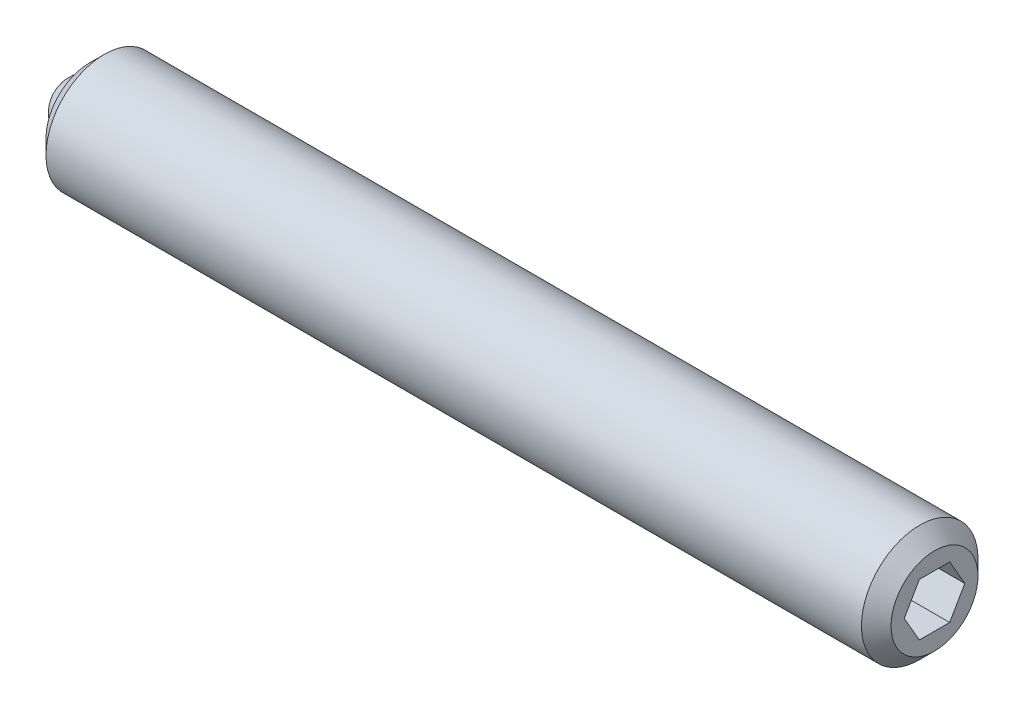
ISO-10303-21;
HEADER;
FILE_DESCRIPTION(('STEP AP214'),'2;1');
FILE_NAME('part.step','',(''),(''),'','','');
FILE_SCHEMA(('AUTOMOTIVE_DESIGN { 1 0 10303 214 1 1 1 1 }'));
ENDSEC;
DATA;
#1=APPLICATION_CONTEXT('core data for automotive mechanical design processes');
#2=APPLICATION_PROTOCOL_DEFINITION('international standard','automotive_design',2000,#1);
#3=PRODUCT_CONTEXT('',#1,'mechanical');
#4=PRODUCT('Part','Part','',(#3));
#5=PRODUCT_RELATED_PRODUCT_CATEGORY('part','',(#4));
#6=PRODUCT_DEFINITION_FORMATION('','',#4);
#7=PRODUCT_DEFINITION_CONTEXT('part definition',#1,'design');
#8=PRODUCT_DEFINITION('design','',#6,#7);
#9=PRODUCT_DEFINITION_SHAPE('','',#8);
#10=(LENGTH_UNIT() NAMED_UNIT(*) SI_UNIT(.MILLI.,.METRE.));
#11=(NAMED_UNIT(*) PLANE_ANGLE_UNIT() SI_UNIT($,.RADIAN.));
#12=(NAMED_UNIT(*) SI_UNIT($,.STERADIAN.) SOLID_ANGLE_UNIT());
#13=UNCERTAINTY_MEASURE_WITH_UNIT(LENGTH_MEASURE(1.E-05),#10,'distance_accuracy_value','');
#14=(GEOMETRIC_REPRESENTATION_CONTEXT(3) GLOBAL_UNCERTAINTY_ASSIGNED_CONTEXT((#13)) GLOBAL_UNIT_ASSIGNED_CONTEXT((#10,
#11,#12)) REPRESENTATION_CONTEXT('',''));
#15=CARTESIAN_POINT('',(0.,0.,0.));
#16=DIRECTION('',(0.,0.,1.));
#17=DIRECTION('',(1.,0.,0.));
#18=AXIS2_PLACEMENT_3D('',#15,#16,#17);
#19=CARTESIAN_POINT('',(0.,0.,0.));
#20=DIRECTION('',(0.,-1.,0.));
#21=DIRECTION('',(0.,0.,-1.));
#22=AXIS2_PLACEMENT_3D('',#19,#20,#21);
#23=SPHERICAL_SURFACE('',#22,0.5);
#24=CARTESIAN_POINT('',(0.,-0.5,0.));
#25=VERTEX_POINT('',#24);
#26=VERTEX_LOOP('',#25);
#27=FACE_BOUND('',#26,.T.);
#28=ADVANCED_FACE('F41',(#27),#23,.T.);
#29=CLOSED_SHELL('',(#28));
#30=MANIFOLD_SOLID_BREP('B2',#29);
#31=CARTESIAN_POINT('',(14.5,0.,0.));
#32=DIRECTION('',(-1.,0.,0.));
#33=DIRECTION('',(0.,0.,1.));
#34=AXIS2_PLACEMENT_3D('',#31,#32,#33);
#35=CYLINDRICAL_SURFACE('',#34,1.);
#36=CARTESIAN_POINT('',(14.246,0.,0.));
#37=DIRECTION('',(1.,0.,0.));
#38=DIRECTION('',(0.,0.,-1.));
#39=AXIS2_PLACEMENT_3D('',#36,#37,#38);
#40=CIRCLE('',#39,1.);
#41=CARTESIAN_POINT('',(14.246,0.,1.));
#42=VERTEX_POINT('',#41);
#43=EDGE_CURVE('E39',#42,#42,#40,.F.);
#44=CARTESIAN_POINT('',(0.254000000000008,0.,0.));
#45=DIRECTION('',(1.,0.,0.));
#46=DIRECTION('',(0.,0.,-1.));
#47=AXIS2_PLACEMENT_3D('',#44,#45,#46);
#48=CIRCLE('',#47,1.);
#49=CARTESIAN_POINT('',(0.254000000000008,0.,1.));
#50=VERTEX_POINT('',#49);
#51=EDGE_CURVE('E157',#50,#50,#48,.T.);
#52=CARTESIAN_POINT('',(14.246,0.,1.));
#53=CARTESIAN_POINT('',(14.10025,0.,1.));
#54=CARTESIAN_POINT('',(13.9545,0.,1.));
#55=CARTESIAN_POINT('',(13.663,0.,1.));
#56=CARTESIAN_POINT('',(13.51725,0.,1.));
#57=CARTESIAN_POINT('',(13.22575,0.,1.));
#58=CARTESIAN_POINT('',(13.08,0.,1.));
#59=CARTESIAN_POINT('',(12.7885,0.,1.));
#60=CARTESIAN_POINT('',(12.64275,0.,1.));
#61=CARTESIAN_POINT('',(12.35125,0.,1.));
#62=CARTESIAN_POINT('',(12.2055,0.,1.));
#63=CARTESIAN_POINT('',(11.914,0.,1.));
#64=CARTESIAN_POINT('',(11.76825,0.,1.));
#65=CARTESIAN_POINT('',(11.47675,0.,1.));
#66=CARTESIAN_POINT('',(11.331,0.,1.));
#67=CARTESIAN_POINT('',(11.0395,0.,1.));
#68=CARTESIAN_POINT('',(10.89375,0.,1.));
#69=CARTESIAN_POINT('',(10.60225,0.,1.));
#70=CARTESIAN_POINT('',(10.4565,0.,1.));
#71=CARTESIAN_POINT('',(10.165,0.,1.));
#72=CARTESIAN_POINT('',(10.01925,0.,1.));
#73=CARTESIAN_POINT('',(9.72775,0.,1.));
#74=CARTESIAN_POINT('',(9.582,0.,1.));
#75=CARTESIAN_POINT('',(9.2905,0.,1.));
#76=CARTESIAN_POINT('',(9.14475,0.,1.));
#77=CARTESIAN_POINT('',(8.85325,0.,1.));
#78=CARTESIAN_POINT('',(8.7075,0.,1.));
#79=CARTESIAN_POINT('',(8.416,0.,1.));
#80=CARTESIAN_POINT('',(8.27025,0.,1.));
#81=CARTESIAN_POINT('',(7.97875,0.,1.));
#82=CARTESIAN_POINT('',(7.833,0.,1.));
#83=CARTESIAN_POINT('',(7.5415,0.,1.));
#84=CARTESIAN_POINT('',(7.39575,0.,1.));
#85=CARTESIAN_POINT('',(7.10425,0.,1.));
#86=CARTESIAN_POINT('',(6.9585,0.,1.));
#87=CARTESIAN_POINT('',(6.667,0.,1.));
#88=CARTESIAN_POINT('',(6.52125,0.,1.));
#89=CARTESIAN_POINT('',(6.22975000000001,0.,1.));
#90=CARTESIAN_POINT('',(6.084,0.,1.));
#91=CARTESIAN_POINT('',(5.79250000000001,0.,1.));
#92=CARTESIAN_POINT('',(5.64675000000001,0.,1.));
#93=CARTESIAN_POINT('',(5.35525000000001,0.,1.));
#94=CARTESIAN_POINT('',(5.20950000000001,0.,1.));
#95=CARTESIAN_POINT('',(4.91800000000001,0.,1.));
#96=CARTESIAN_POINT('',(4.77225000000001,0.,1.));
#97=CARTESIAN_POINT('',(4.48075000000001,0.,1.));
#98=CARTESIAN_POINT('',(4.33500000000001,0.,1.));
#99=CARTESIAN_POINT('',(4.04350000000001,0.,1.));
#100=CARTESIAN_POINT('',(3.89775000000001,0.,1.));
#101=CARTESIAN_POINT('',(3.60625000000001,0.,1.));
#102=CARTESIAN_POINT('',(3.46050000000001,0.,1.));
#103=CARTESIAN_POINT('',(3.16900000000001,0.,1.));
#104=CARTESIAN_POINT('',(3.02325000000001,0.,1.));
#105=CARTESIAN_POINT('',(2.73175000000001,0.,1.));
#106=CARTESIAN_POINT('',(2.58600000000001,0.,1.));
#107=CARTESIAN_POINT('',(2.29450000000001,0.,1.));
#108=CARTESIAN_POINT('',(2.14875000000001,0.,1.));
#109=CARTESIAN_POINT('',(1.85725000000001,0.,1.));
#110=CARTESIAN_POINT('',(1.71150000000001,0.,1.));
#111=CARTESIAN_POINT('',(1.42000000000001,0.,1.));
#112=CARTESIAN_POINT('',(1.27425000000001,0.,1.));
#113=CARTESIAN_POINT('',(0.982750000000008,0.,1.));
#114=CARTESIAN_POINT('',(0.837000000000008,0.,1.));
#115=CARTESIAN_POINT('',(0.545500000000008,0.,1.));
#116=CARTESIAN_POINT('',(0.399750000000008,0.,1.));
#117=CARTESIAN_POINT('',(0.254000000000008,0.,1.));
#118=B_SPLINE_CURVE_WITH_KNOTS('',3,(#52,#53,#54,#55,#56,#57,#58,#59,#60,#61,#62,#63,#64,#65,
#66,#67,#68,#69,#70,#71,#72,#73,#74,#75,#76,#77,#78,#79,#80,#81,#82,#83,#84,#85,#86,#87,#88,#89,
#90,#91,#92,#93,#94,#95,#96,#97,#98,#99,#100,#101,#102,#103,#104,#105,#106,#107,#108,#109,#110,
#111,#112,#113,#114,#115,#116,#117),.UNSPECIFIED.,.F.,.F.,(4,2,2,2,2,2,2,2,2,2,2,2,2,2,2,2,2,2,
2,2,2,2,2,2,2,2,2,2,2,2,2,2,4),(0.,0.437249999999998,0.874499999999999,1.31175,1.749,2.18625,
2.6235,3.06075,3.498,3.93525,4.3725,4.80975,5.247,5.68425,6.1215,6.55875,6.996,7.43325,7.8705,
8.30774999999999,8.74499999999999,9.18224999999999,9.6195,10.05675,10.494,10.93125,11.3685,
11.80575,12.243,12.68025,13.1175,13.55475,13.992),.UNSPECIFIED.);
#119=EDGE_CURVE('BSEAM54',#42,#50,#118,.T.);
#120=ORIENTED_EDGE('',*,*,#43,.T.);
#121=ORIENTED_EDGE('',*,*,#51,.T.);
#122=ORIENTED_EDGE('',*,*,#119,.T.);
#123=ORIENTED_EDGE('',*,*,#119,.F.);
#124=EDGE_LOOP('',(#120,#122,#121,#123));
#125=FACE_BOUND('',#124,.T.);
#126=ADVANCED_FACE('F54',(#125),#35,.T.);
#127=CARTESIAN_POINT('',(14.5,0.,0.));
#128=DIRECTION('',(1.,0.,0.));
#129=DIRECTION('',(0.,0.,-1.));
#130=AXIS2_PLACEMENT_3D('',#127,#128,#129);
#131=PLANE('',#130);
#132=DIRECTION('',(0.,0.866025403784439,-0.5));
#133=VECTOR('',#132,1.);
#134=CARTESIAN_POINT('',(14.5,-0.45,-0.259807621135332));
#135=LINE('',#134,#133);
#136=CARTESIAN_POINT('',(14.5,-0.45,-0.259807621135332));
#137=VERTEX_POINT('',#136);
#138=CARTESIAN_POINT('',(14.5,0.,-0.519615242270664));
#139=VERTEX_POINT('',#138);
#140=EDGE_CURVE('E69',#137,#139,#135,.T.);
#141=ORIENTED_EDGE('',*,*,#140,.F.);
#142=DIRECTION('',(0.,0.,-1.));
#143=VECTOR('',#142,1.);
#144=CARTESIAN_POINT('',(14.5,-0.45,0.259807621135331));
#145=LINE('',#144,#143);
#146=CARTESIAN_POINT('',(14.5,-0.45,0.259807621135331));
#147=VERTEX_POINT('',#146);
#148=EDGE_CURVE('E153',#147,#137,#145,.T.);
#149=ORIENTED_EDGE('',*,*,#148,.F.);
#150=DIRECTION('',(0.,-0.866025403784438,-0.5));
#151=VECTOR('',#150,1.);
#152=CARTESIAN_POINT('',(14.5,0.,0.519615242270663));
#153=LINE('',#152,#151);
#154=CARTESIAN_POINT('',(14.5,0.,0.519615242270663));
#155=VERTEX_POINT('',#154);
#156=EDGE_CURVE('E151',#155,#147,#153,.T.);
#157=ORIENTED_EDGE('',*,*,#156,.F.);
#158=DIRECTION('',(0.,-0.866025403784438,0.5));
#159=VECTOR('',#158,1.);
#160=CARTESIAN_POINT('',(14.5,0.45,0.259807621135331));
#161=LINE('',#160,#159);
#162=CARTESIAN_POINT('',(14.5,0.45,0.259807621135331));
#163=VERTEX_POINT('',#162);
#164=EDGE_CURVE('E117',#163,#155,#161,.T.);
#165=ORIENTED_EDGE('',*,*,#164,.F.);
#166=DIRECTION('',(0.,0.,1.));
#167=VECTOR('',#166,1.);
#168=CARTESIAN_POINT('',(14.5,0.45,-0.259807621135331));
#169=LINE('',#168,#167);
#170=CARTESIAN_POINT('',(14.5,0.45,-0.259807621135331));
#171=VERTEX_POINT('',#170);
#172=EDGE_CURVE('E147',#171,#163,#169,.T.);
#173=ORIENTED_EDGE('',*,*,#172,.F.);
#174=DIRECTION('',(0.,0.866025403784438,0.5));
#175=VECTOR('',#174,1.);
#176=CARTESIAN_POINT('',(14.5,0.,-0.519615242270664));
#177=LINE('',#176,#175);
#178=EDGE_CURVE('E143',#139,#171,#177,.T.);
#179=ORIENTED_EDGE('',*,*,#178,.F.);
#180=EDGE_LOOP('',(#141,#149,#157,#165,#173,#179));
#181=FACE_BOUND('',#180,.T.);
#182=CARTESIAN_POINT('',(14.5,0.,0.));
#183=DIRECTION('',(1.,0.,0.));
#184=DIRECTION('',(0.,0.,-1.));
#185=AXIS2_PLACEMENT_3D('',#182,#183,#184);
#186=CIRCLE('',#185,0.746000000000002);
#187=CARTESIAN_POINT('',(14.5,0.,-0.746000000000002));
#188=VERTEX_POINT('',#187);
#189=EDGE_CURVE('E62',#188,#188,#186,.T.);
#190=ORIENTED_EDGE('',*,*,#189,.T.);
#191=EDGE_LOOP('',(#190));
#192=FACE_BOUND('',#191,.T.);
#193=ADVANCED_FACE('F170',(#181,#192),#131,.T.);
#194=CARTESIAN_POINT('',(0.,0.,0.));
#195=DIRECTION('',(1.,0.,0.));
#196=DIRECTION('',(0.,0.,-1.));
#197=AXIS2_PLACEMENT_3D('',#194,#195,#196);
#198=PLANE('',#197);
#199=CARTESIAN_POINT('',(0.,0.,0.));
#200=DIRECTION('',(-1.,0.,0.));
#201=DIRECTION('',(0.,0.,1.));
#202=AXIS2_PLACEMENT_3D('',#199,#200,#201);
#203=CIRCLE('',#202,0.5);
#204=CARTESIAN_POINT('',(0.,0.,0.5));
#205=VERTEX_POINT('',#204);
#206=EDGE_CURVE('E225',#205,#205,#203,.T.);
#207=ORIENTED_EDGE('',*,*,#206,.F.);
#208=EDGE_LOOP('',(#207));
#209=FACE_BOUND('',#208,.T.);
#210=CARTESIAN_POINT('',(0.,0.,0.));
#211=DIRECTION('',(1.,0.,0.));
#212=DIRECTION('',(0.,0.,-1.));
#213=AXIS2_PLACEMENT_3D('',#210,#211,#212);
#214=CIRCLE('',#213,0.745999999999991);
#215=CARTESIAN_POINT('',(0.,0.,-0.745999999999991));
#216=VERTEX_POINT('',#215);
#217=EDGE_CURVE('E165',#216,#216,#214,.F.);
#218=ORIENTED_EDGE('',*,*,#217,.T.);
#219=EDGE_LOOP('',(#218));
#220=FACE_BOUND('',#219,.T.);
#221=ADVANCED_FACE('F182',(#209,#220),#198,.F.);
#222=CARTESIAN_POINT('',(0.254000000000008,0.,0.));
#223=DIRECTION('',(1.,0.,0.));
#224=DIRECTION('',(0.,0.,-1.));
#225=AXIS2_PLACEMENT_3D('',#222,#223,#224);
#226=CONICAL_SURFACE('',#225,1.,0.78539816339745);
#227=ORIENTED_EDGE('',*,*,#217,.F.);
#228=EDGE_LOOP('',(#227));
#229=FACE_BOUND('',#228,.T.);
#230=ORIENTED_EDGE('',*,*,#51,.F.);
#231=EDGE_LOOP('',(#230));
#232=FACE_BOUND('',#231,.T.);
#233=ADVANCED_FACE('F174',(#229,#232),#226,.T.);
#234=CARTESIAN_POINT('',(14.5,0.,0.));
#235=DIRECTION('',(-1.,0.,0.));
#236=DIRECTION('',(0.,0.,1.));
#237=AXIS2_PLACEMENT_3D('',#234,#235,#236);
#238=CONICAL_SURFACE('',#237,0.746000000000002,0.785398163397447);
#239=ORIENTED_EDGE('',*,*,#43,.F.);
#240=EDGE_LOOP('',(#239));
#241=FACE_BOUND('',#240,.T.);
#242=ORIENTED_EDGE('',*,*,#189,.F.);
#243=EDGE_LOOP('',(#242));
#244=FACE_BOUND('',#243,.T.);
#245=ADVANCED_FACE('F56',(#241,#244),#238,.T.);
#246=CARTESIAN_POINT('',(12.5,-0.45,-0.259807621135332));
#247=DIRECTION('',(0.,-0.5,-0.866025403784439));
#248=DIRECTION('',(0.,0.866025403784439,-0.5));
#249=AXIS2_PLACEMENT_3D('',#246,#247,#248);
#250=PLANE('',#249);
#251=ORIENTED_EDGE('',*,*,#140,.T.);
#252=DIRECTION('',(1.,0.,0.));
#253=VECTOR('',#252,1.);
#254=CARTESIAN_POINT('',(12.5,0.,-0.519615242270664));
#255=LINE('',#254,#253);
#256=CARTESIAN_POINT('',(12.5,0.,-0.519615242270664));
#257=VERTEX_POINT('',#256);
#258=EDGE_CURVE('E99',#257,#139,#255,.T.);
#259=ORIENTED_EDGE('',*,*,#258,.F.);
#260=DIRECTION('',(0.,0.866025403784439,-0.5));
#261=VECTOR('',#260,1.);
#262=CARTESIAN_POINT('',(12.5,-0.45,-0.259807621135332));
#263=LINE('',#262,#261);
#264=CARTESIAN_POINT('',(12.5,-0.45,-0.259807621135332));
#265=VERTEX_POINT('',#264);
#266=EDGE_CURVE('E155',#265,#257,#263,.T.);
#267=ORIENTED_EDGE('',*,*,#266,.F.);
#268=DIRECTION('',(1.,0.,0.));
#269=VECTOR('',#268,1.);
#270=CARTESIAN_POINT('',(12.5,-0.45,-0.259807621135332));
#271=LINE('',#270,#269);
#272=EDGE_CURVE('E77',#265,#137,#271,.T.);
#273=ORIENTED_EDGE('',*,*,#272,.T.);
#274=EDGE_LOOP('',(#251,#259,#267,#273));
#275=FACE_BOUND('',#274,.T.);
#276=ADVANCED_FACE('F173',(#275),#250,.F.);
#277=CARTESIAN_POINT('',(12.5,-0.45,0.259807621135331));
#278=DIRECTION('',(0.,-1.,0.));
#279=DIRECTION('',(0.,0.,-1.));
#280=AXIS2_PLACEMENT_3D('',#277,#278,#279);
#281=PLANE('',#280);
#282=ORIENTED_EDGE('',*,*,#148,.T.);
#283=ORIENTED_EDGE('',*,*,#272,.F.);
#284=DIRECTION('',(0.,0.,-1.));
#285=VECTOR('',#284,1.);
#286=CARTESIAN_POINT('',(12.5,-0.45,0.259807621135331));
#287=LINE('',#286,#285);
#288=CARTESIAN_POINT('',(12.5,-0.45,0.259807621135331));
#289=VERTEX_POINT('',#288);
#290=EDGE_CURVE('E129',#289,#265,#287,.T.);
#291=ORIENTED_EDGE('',*,*,#290,.F.);
#292=DIRECTION('',(1.,0.,0.));
#293=VECTOR('',#292,1.);
#294=CARTESIAN_POINT('',(12.5,-0.45,0.259807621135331));
#295=LINE('',#294,#293);
#296=EDGE_CURVE('E121',#289,#147,#295,.T.);
#297=ORIENTED_EDGE('',*,*,#296,.T.);
#298=EDGE_LOOP('',(#282,#283,#291,#297));
#299=FACE_BOUND('',#298,.T.);
#300=ADVANCED_FACE('F180',(#299),#281,.F.);
#301=CARTESIAN_POINT('',(12.5,0.,0.519615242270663));
#302=DIRECTION('',(0.,-0.5,0.866025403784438));
#303=DIRECTION('',(0.,-0.866025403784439,-0.5));
#304=AXIS2_PLACEMENT_3D('',#301,#302,#303);
#305=PLANE('',#304);
#306=ORIENTED_EDGE('',*,*,#156,.T.);
#307=ORIENTED_EDGE('',*,*,#296,.F.);
#308=DIRECTION('',(0.,-0.866025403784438,-0.5));
#309=VECTOR('',#308,1.);
#310=CARTESIAN_POINT('',(12.5,0.,0.519615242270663));
#311=LINE('',#310,#309);
#312=CARTESIAN_POINT('',(12.5,0.,0.519615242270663));
#313=VERTEX_POINT('',#312);
#314=EDGE_CURVE('E125',#313,#289,#311,.T.);
#315=ORIENTED_EDGE('',*,*,#314,.F.);
#316=DIRECTION('',(1.,0.,0.));
#317=VECTOR('',#316,1.);
#318=CARTESIAN_POINT('',(12.5,0.,0.519615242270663));
#319=LINE('',#318,#317);
#320=EDGE_CURVE('E110',#313,#155,#319,.T.);
#321=ORIENTED_EDGE('',*,*,#320,.T.);
#322=EDGE_LOOP('',(#306,#307,#315,#321));
#323=FACE_BOUND('',#322,.T.);
#324=ADVANCED_FACE('F126',(#323),#305,.F.);
#325=CARTESIAN_POINT('',(12.5,0.45,0.259807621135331));
#326=DIRECTION('',(0.,0.5,0.866025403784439));
#327=DIRECTION('',(0.,-0.866025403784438,0.5));
#328=AXIS2_PLACEMENT_3D('',#325,#326,#327);
#329=PLANE('',#328);
#330=ORIENTED_EDGE('',*,*,#164,.T.);
#331=ORIENTED_EDGE('',*,*,#320,.F.);
#332=DIRECTION('',(0.,-0.866025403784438,0.5));
#333=VECTOR('',#332,1.);
#334=CARTESIAN_POINT('',(12.5,0.45,0.259807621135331));
#335=LINE('',#334,#333);
#336=CARTESIAN_POINT('',(12.5,0.45,0.259807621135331));
#337=VERTEX_POINT('',#336);
#338=EDGE_CURVE('E114',#337,#313,#335,.T.);
#339=ORIENTED_EDGE('',*,*,#338,.F.);
#340=DIRECTION('',(1.,0.,0.));
#341=VECTOR('',#340,1.);
#342=CARTESIAN_POINT('',(12.5,0.45,0.259807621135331));
#343=LINE('',#342,#341);
#344=EDGE_CURVE('E122',#337,#163,#343,.T.);
#345=ORIENTED_EDGE('',*,*,#344,.T.);
#346=EDGE_LOOP('',(#330,#331,#339,#345));
#347=FACE_BOUND('',#346,.T.);
#348=ADVANCED_FACE('F112',(#347),#329,.F.);
#349=CARTESIAN_POINT('',(12.5,0.45,-0.259807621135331));
#350=DIRECTION('',(0.,1.,0.));
#351=DIRECTION('',(0.,0.,1.));
#352=AXIS2_PLACEMENT_3D('',#349,#350,#351);
#353=PLANE('',#352);
#354=ORIENTED_EDGE('',*,*,#172,.T.);
#355=ORIENTED_EDGE('',*,*,#344,.F.);
#356=DIRECTION('',(0.,0.,1.));
#357=VECTOR('',#356,1.);
#358=CARTESIAN_POINT('',(12.5,0.45,-0.259807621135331));
#359=LINE('',#358,#357);
#360=CARTESIAN_POINT('',(12.5,0.45,-0.259807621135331));
#361=VERTEX_POINT('',#360);
#362=EDGE_CURVE('E135',#361,#337,#359,.T.);
#363=ORIENTED_EDGE('',*,*,#362,.F.);
#364=DIRECTION('',(1.,0.,0.));
#365=VECTOR('',#364,1.);
#366=CARTESIAN_POINT('',(12.5,0.45,-0.259807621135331));
#367=LINE('',#366,#365);
#368=EDGE_CURVE('E160',#361,#171,#367,.T.);
#369=ORIENTED_EDGE('',*,*,#368,.T.);
#370=EDGE_LOOP('',(#354,#355,#363,#369));
#371=FACE_BOUND('',#370,.T.);
#372=ADVANCED_FACE('F201',(#371),#353,.F.);
#373=CARTESIAN_POINT('',(12.5,0.,-0.519615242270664));
#374=DIRECTION('',(0.,0.5,-0.866025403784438));
#375=DIRECTION('',(0.,0.866025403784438,0.5));
#376=AXIS2_PLACEMENT_3D('',#373,#374,#375);
#377=PLANE('',#376);
#378=ORIENTED_EDGE('',*,*,#178,.T.);
#379=ORIENTED_EDGE('',*,*,#368,.F.);
#380=DIRECTION('',(0.,0.866025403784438,0.5));
#381=VECTOR('',#380,1.);
#382=CARTESIAN_POINT('',(12.5,0.,-0.519615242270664));
#383=LINE('',#382,#381);
#384=EDGE_CURVE('E137',#257,#361,#383,.T.);
#385=ORIENTED_EDGE('',*,*,#384,.F.);
#386=ORIENTED_EDGE('',*,*,#258,.T.);
#387=EDGE_LOOP('',(#378,#379,#385,#386));
#388=FACE_BOUND('',#387,.T.);
#389=ADVANCED_FACE('F198',(#388),#377,.F.);
#390=CARTESIAN_POINT('',(12.5,0.,0.));
#391=DIRECTION('',(1.,0.,0.));
#392=DIRECTION('',(0.,0.,-1.));
#393=AXIS2_PLACEMENT_3D('',#390,#391,#392);
#394=PLANE('',#393);
#395=ORIENTED_EDGE('',*,*,#266,.T.);
#396=ORIENTED_EDGE('',*,*,#384,.T.);
#397=ORIENTED_EDGE('',*,*,#362,.T.);
#398=ORIENTED_EDGE('',*,*,#338,.T.);
#399=ORIENTED_EDGE('',*,*,#314,.T.);
#400=ORIENTED_EDGE('',*,*,#290,.T.);
#401=EDGE_LOOP('',(#395,#396,#397,#398,#399,#400));
#402=FACE_BOUND('',#401,.T.);
#403=ADVANCED_FACE('F132',(#402),#394,.T.);
#404=CARTESIAN_POINT('',(0.5,0.,0.));
#405=DIRECTION('',(-1.,0.,0.));
#406=DIRECTION('',(0.,0.,1.));
#407=AXIS2_PLACEMENT_3D('',#404,#405,#406);
#408=CYLINDRICAL_SURFACE('',#407,0.5);
#409=CARTESIAN_POINT('',(0.5,0.,0.));
#410=DIRECTION('',(-1.,0.,0.));
#411=DIRECTION('',(0.,0.,1.));
#412=AXIS2_PLACEMENT_3D('',#409,#410,#411);
#413=CIRCLE('',#412,0.5);
#414=CARTESIAN_POINT('',(0.5,0.,0.5));
#415=VERTEX_POINT('',#414);
#416=EDGE_CURVE('E144',#415,#415,#413,.T.);
#417=ORIENTED_EDGE('',*,*,#416,.F.);
#418=EDGE_LOOP('',(#417));
#419=FACE_BOUND('',#418,.T.);
#420=ORIENTED_EDGE('',*,*,#206,.T.);
#421=EDGE_LOOP('',(#420));
#422=FACE_BOUND('',#421,.T.);
#423=ADVANCED_FACE('F214',(#419,#422),#408,.F.);
#424=CARTESIAN_POINT('',(0.5,0.,0.));
#425=DIRECTION('',(-1.,0.,0.));
#426=DIRECTION('',(0.,0.,1.));
#427=AXIS2_PLACEMENT_3D('',#424,#425,#426);
#428=PLANE('',#427);
#429=ORIENTED_EDGE('',*,*,#416,.T.);
#430=EDGE_LOOP('',(#429));
#431=FACE_BOUND('',#430,.T.);
#432=ADVANCED_FACE('F217',(#431),#428,.T.);
#433=CLOSED_SHELL('',(#126,#193,#221,#233,#245,#276,#300,#324,#348,#372,#389,#403,#423,#432));
#434=MANIFOLD_SOLID_BREP('B6',#433);
#435=ADVANCED_BREP_SHAPE_REPRESENTATION('',(#18,#30,#434),#14);
#436=SHAPE_DEFINITION_REPRESENTATION(#9,#435);
ENDSEC;
END-ISO-10303-21;
